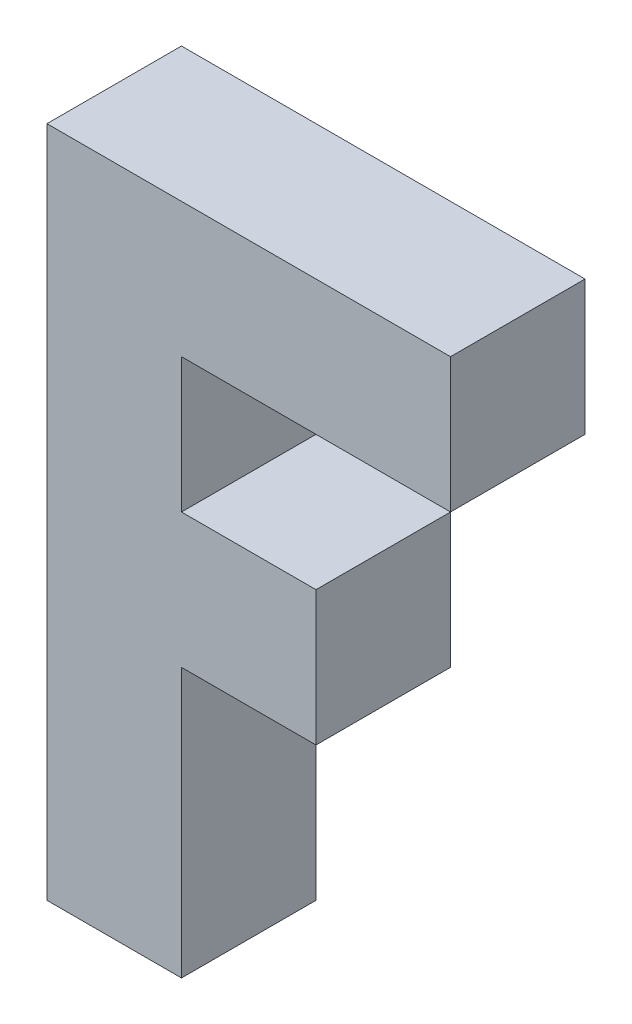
from build123d import *

# Parameters (mm, degrees)
BOSS_EXTRU_1_DEPTH = 10


with BuildPart() as part:
    # Esquisse1 → Boss.-Extru.1 (new body)
    with BuildSketch(Plane.XY):
        Polygon((10, 30), (10, 40), (30, 40), (30, 50), (10, 50), (0, 50), (0, 0), (10, 0), (10, 20), (20, 20), (20, 30), align=None)
    extrude(amount=BOSS_EXTRU_1_DEPTH)


solid = part.part
